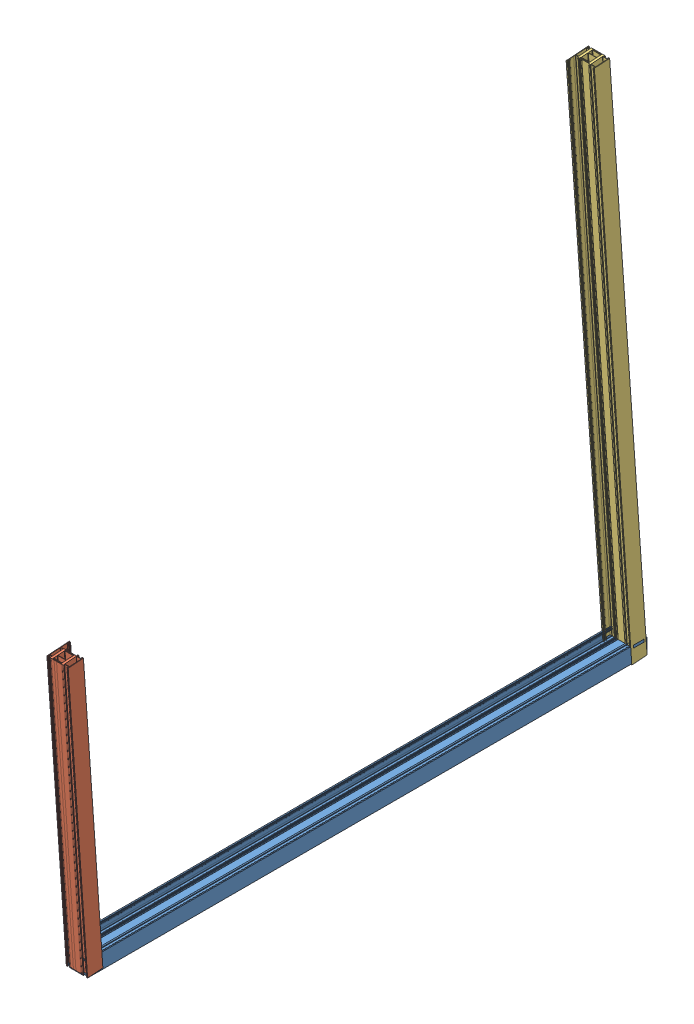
SolidWorks assembly Fenster unten.SLDASM, configuration Standard (file format 5000). Lengths in mm.
Overall size (75 1895.89 2043.64).
3 component instances, 3 part files, 6 mates.
Components (placement in the parent):
- Rahmen 1-1: Rahmen 1.SLDPRT [Standard] at (-34.4668 -47.0827 -987.5) size (75 79 1975)
- Rahmen 2-1: Rahmen 2.SLDPRT [Standard] at (-34.4668 -47.0827 987.5) x (1 0 0) z (0 0.997564 0.069756) size (75 79 984)
- Rahmen 3-1: Rahmen 3.SLDPRT [Standard] at (-34.4668 1843.3012 -855.3115) x (1 0 0) z (0 -0.997564 -0.069756) size (75 79 1895)
Mates (geometry in assembly coordinates):
- Deckungsgleich1: coincident aligned: plane of Rahmen 1-1 through (-34.4668 -47.0827 987.5) normal (-1 0 0); plane of Rahmen 2-1 through (-34.4668 934.5203 1056.1404) normal (-1 0 0)
- Deckungsgleich2: coincident aligned: line of Rahmen 1-1 through (-31.0668 -47.0827 987.5) axis (-1 0 0); line of Rahmen 2-1 through (-31.0668 -47.0827 987.5) axis (-1 0 0)
- Winkel1: planar angle = 1.500983 rad aligned: plane of Rahmen 1-1 through (-34.4668 -47.0827 987.5) normal (0 -1 0); plane of Rahmen 2-1 through (-34.4668 934.5203 1056.1404) normal (0 -0.069756 0.997564)
- Deckungsgleich5: coincident aligned: plane of Rahmen 1-1 through (-34.4668 -47.0827 987.5) normal (-1 0 0); plane of Rahmen 3-1 through (-34.4668 -47.0827 -987.5) normal (-1 0 0)
- Deckungsgleich6: coincident aligned: line of Rahmen 1-1 through (-31.0668 -47.0827 -987.5) axis (-1 0 0); line of Rahmen 3-1 through (-31.0668 -47.0827 -987.5) axis (-1 0 0)
- Winkel2: planar angle = 1.640609 rad aligned: plane of Rahmen 1-1 through (-34.4668 -47.0827 987.5) normal (0 -1 0); plane of Rahmen 3-1 through (-34.4668 -47.0827 -987.5) normal (0 0.069756 -0.997564)
